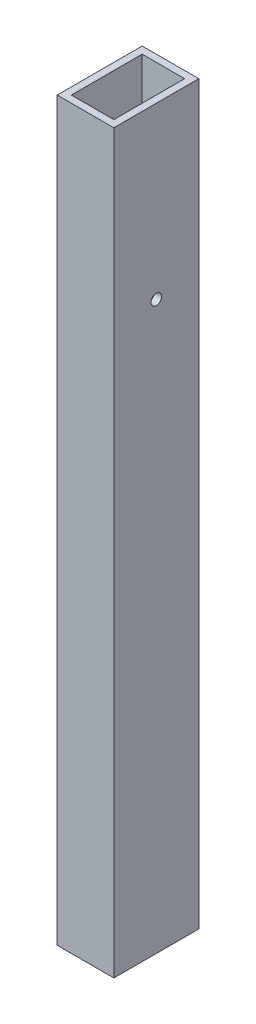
ISO-10303-21;
HEADER;
FILE_DESCRIPTION(('STEP AP214'),'2;1');
FILE_NAME('part.step','',(''),(''),'','','');
FILE_SCHEMA(('AUTOMOTIVE_DESIGN { 1 0 10303 214 1 1 1 1 }'));
ENDSEC;
DATA;
#1=APPLICATION_CONTEXT('core data for automotive mechanical design processes');
#2=APPLICATION_PROTOCOL_DEFINITION('international standard','automotive_design',2000,#1);
#3=PRODUCT_CONTEXT('',#1,'mechanical');
#4=PRODUCT('Part','Part','',(#3));
#5=PRODUCT_RELATED_PRODUCT_CATEGORY('part','',(#4));
#6=PRODUCT_DEFINITION_FORMATION('','',#4);
#7=PRODUCT_DEFINITION_CONTEXT('part definition',#1,'design');
#8=PRODUCT_DEFINITION('design','',#6,#7);
#9=PRODUCT_DEFINITION_SHAPE('','',#8);
#10=(LENGTH_UNIT() NAMED_UNIT(*) SI_UNIT(.MILLI.,.METRE.));
#11=(NAMED_UNIT(*) PLANE_ANGLE_UNIT() SI_UNIT($,.RADIAN.));
#12=(NAMED_UNIT(*) SI_UNIT($,.STERADIAN.) SOLID_ANGLE_UNIT());
#13=UNCERTAINTY_MEASURE_WITH_UNIT(LENGTH_MEASURE(1.E-05),#10,'distance_accuracy_value','');
#14=(GEOMETRIC_REPRESENTATION_CONTEXT(3) GLOBAL_UNCERTAINTY_ASSIGNED_CONTEXT((#13)) GLOBAL_UNIT_ASSIGNED_CONTEXT((#10,
#11,#12)) REPRESENTATION_CONTEXT('',''));
#15=CARTESIAN_POINT('',(0.,0.,0.));
#16=DIRECTION('',(0.,0.,1.));
#17=DIRECTION('',(1.,0.,0.));
#18=AXIS2_PLACEMENT_3D('',#15,#16,#17);
#19=CARTESIAN_POINT('',(-25.4,-660.4,38.1));
#20=DIRECTION('',(-1.,0.,0.));
#21=DIRECTION('',(0.,0.,1.));
#22=AXIS2_PLACEMENT_3D('',#19,#20,#21);
#23=PLANE('',#22);
#24=CARTESIAN_POINT('',(-25.4,-152.4,0.));
#25=DIRECTION('',(-1.,0.,0.));
#26=DIRECTION('',(0.,0.,1.));
#27=AXIS2_PLACEMENT_3D('',#24,#25,#26);
#28=CIRCLE('',#27,4.76249999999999);
#29=CARTESIAN_POINT('',(-25.4,-152.4,4.76249999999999));
#30=VERTEX_POINT('',#29);
#31=EDGE_CURVE('E191',#30,#30,#28,.T.);
#32=ORIENTED_EDGE('',*,*,#31,.F.);
#33=EDGE_LOOP('',(#32));
#34=FACE_BOUND('',#33,.T.);
#35=DIRECTION('',(0.,0.,1.));
#36=VECTOR('',#35,1.);
#37=CARTESIAN_POINT('',(-25.4,0.,38.1));
#38=LINE('',#37,#36);
#39=CARTESIAN_POINT('',(-25.4,0.,-38.1));
#40=VERTEX_POINT('',#39);
#41=CARTESIAN_POINT('',(-25.4,0.,38.1));
#42=VERTEX_POINT('',#41);
#43=EDGE_CURVE('E130',#40,#42,#38,.T.);
#44=ORIENTED_EDGE('',*,*,#43,.F.);
#45=DIRECTION('',(0.,1.,0.));
#46=VECTOR('',#45,1.);
#47=CARTESIAN_POINT('',(-25.4,-660.4,-38.1));
#48=LINE('',#47,#46);
#49=CARTESIAN_POINT('',(-25.4,-660.4,-38.1));
#50=VERTEX_POINT('',#49);
#51=EDGE_CURVE('E11',#50,#40,#48,.T.);
#52=ORIENTED_EDGE('',*,*,#51,.F.);
#53=DIRECTION('',(0.,0.,1.));
#54=VECTOR('',#53,1.);
#55=CARTESIAN_POINT('',(-25.4,-660.4,38.1));
#56=LINE('',#55,#54);
#57=CARTESIAN_POINT('',(-25.4,-660.4,38.1));
#58=VERTEX_POINT('',#57);
#59=EDGE_CURVE('E144',#50,#58,#56,.T.);
#60=ORIENTED_EDGE('',*,*,#59,.T.);
#61=DIRECTION('',(0.,1.,0.));
#62=VECTOR('',#61,1.);
#63=CARTESIAN_POINT('',(-25.4,-660.4,38.1));
#64=LINE('',#63,#62);
#65=EDGE_CURVE('E155',#58,#42,#64,.T.);
#66=ORIENTED_EDGE('',*,*,#65,.T.);
#67=EDGE_LOOP('',(#44,#52,#60,#66));
#68=FACE_BOUND('',#67,.T.);
#69=ADVANCED_FACE('F31',(#34,#68),#23,.T.);
#70=CARTESIAN_POINT('',(-25.4,-660.4,-38.1));
#71=DIRECTION('',(0.,0.,-1.));
#72=DIRECTION('',(-1.,0.,0.));
#73=AXIS2_PLACEMENT_3D('',#70,#71,#72);
#74=PLANE('',#73);
#75=DIRECTION('',(-1.,0.,0.));
#76=VECTOR('',#75,1.);
#77=CARTESIAN_POINT('',(-25.4,0.,-38.1));
#78=LINE('',#77,#76);
#79=CARTESIAN_POINT('',(25.4,0.,-38.1));
#80=VERTEX_POINT('',#79);
#81=EDGE_CURVE('E141',#80,#40,#78,.T.);
#82=ORIENTED_EDGE('',*,*,#81,.F.);
#83=DIRECTION('',(0.,1.,0.));
#84=VECTOR('',#83,1.);
#85=CARTESIAN_POINT('',(25.4,-660.4,-38.1));
#86=LINE('',#85,#84);
#87=CARTESIAN_POINT('',(25.4,-660.4,-38.1));
#88=VERTEX_POINT('',#87);
#89=EDGE_CURVE('E39',#88,#80,#86,.T.);
#90=ORIENTED_EDGE('',*,*,#89,.F.);
#91=DIRECTION('',(-1.,0.,0.));
#92=VECTOR('',#91,1.);
#93=CARTESIAN_POINT('',(-25.4,-660.4,-38.1));
#94=LINE('',#93,#92);
#95=EDGE_CURVE('E153',#88,#50,#94,.T.);
#96=ORIENTED_EDGE('',*,*,#95,.T.);
#97=ORIENTED_EDGE('',*,*,#51,.T.);
#98=EDGE_LOOP('',(#82,#90,#96,#97));
#99=FACE_BOUND('',#98,.T.);
#100=ADVANCED_FACE('F169',(#99),#74,.T.);
#101=CARTESIAN_POINT('',(25.4,-660.4,38.1));
#102=DIRECTION('',(1.,0.,0.));
#103=DIRECTION('',(0.,0.,-1.));
#104=AXIS2_PLACEMENT_3D('',#101,#102,#103);
#105=PLANE('',#104);
#106=CARTESIAN_POINT('',(25.4,-152.4,0.));
#107=DIRECTION('',(1.,0.,0.));
#108=DIRECTION('',(0.,0.,-1.));
#109=AXIS2_PLACEMENT_3D('',#106,#107,#108);
#110=CIRCLE('',#109,4.76249999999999);
#111=CARTESIAN_POINT('',(25.4,-152.4,-4.76249999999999));
#112=VERTEX_POINT('',#111);
#113=EDGE_CURVE('E198',#112,#112,#110,.T.);
#114=ORIENTED_EDGE('',*,*,#113,.F.);
#115=EDGE_LOOP('',(#114));
#116=FACE_BOUND('',#115,.T.);
#117=DIRECTION('',(0.,0.,-1.));
#118=VECTOR('',#117,1.);
#119=CARTESIAN_POINT('',(25.4,0.,38.1));
#120=LINE('',#119,#118);
#121=CARTESIAN_POINT('',(25.4,0.,38.1));
#122=VERTEX_POINT('',#121);
#123=EDGE_CURVE('E138',#122,#80,#120,.T.);
#124=ORIENTED_EDGE('',*,*,#123,.F.);
#125=DIRECTION('',(0.,1.,0.));
#126=VECTOR('',#125,1.);
#127=CARTESIAN_POINT('',(25.4,-660.4,38.1));
#128=LINE('',#127,#126);
#129=CARTESIAN_POINT('',(25.4,-660.4,38.1));
#130=VERTEX_POINT('',#129);
#131=EDGE_CURVE('E158',#130,#122,#128,.T.);
#132=ORIENTED_EDGE('',*,*,#131,.F.);
#133=DIRECTION('',(0.,0.,-1.));
#134=VECTOR('',#133,1.);
#135=CARTESIAN_POINT('',(25.4,-660.4,38.1));
#136=LINE('',#135,#134);
#137=EDGE_CURVE('E150',#130,#88,#136,.T.);
#138=ORIENTED_EDGE('',*,*,#137,.T.);
#139=ORIENTED_EDGE('',*,*,#89,.T.);
#140=EDGE_LOOP('',(#124,#132,#138,#139));
#141=FACE_BOUND('',#140,.T.);
#142=ADVANCED_FACE('F175',(#116,#141),#105,.T.);
#143=CARTESIAN_POINT('',(-25.4,-660.4,38.1));
#144=DIRECTION('',(0.,0.,1.));
#145=DIRECTION('',(1.,0.,0.));
#146=AXIS2_PLACEMENT_3D('',#143,#144,#145);
#147=PLANE('',#146);
#148=DIRECTION('',(1.,0.,0.));
#149=VECTOR('',#148,1.);
#150=CARTESIAN_POINT('',(-25.4,0.,38.1));
#151=LINE('',#150,#149);
#152=EDGE_CURVE('E135',#42,#122,#151,.T.);
#153=ORIENTED_EDGE('',*,*,#152,.F.);
#154=ORIENTED_EDGE('',*,*,#65,.F.);
#155=DIRECTION('',(1.,0.,0.));
#156=VECTOR('',#155,1.);
#157=CARTESIAN_POINT('',(-25.4,-660.4,38.1));
#158=LINE('',#157,#156);
#159=EDGE_CURVE('E147',#58,#130,#158,.T.);
#160=ORIENTED_EDGE('',*,*,#159,.T.);
#161=ORIENTED_EDGE('',*,*,#131,.T.);
#162=EDGE_LOOP('',(#153,#154,#160,#161));
#163=FACE_BOUND('',#162,.T.);
#164=ADVANCED_FACE('F165',(#163),#147,.T.);
#165=CARTESIAN_POINT('',(-25.4,-660.4,-38.1));
#166=DIRECTION('',(0.,-1.,0.));
#167=DIRECTION('',(0.,0.,-1.));
#168=AXIS2_PLACEMENT_3D('',#165,#166,#167);
#169=PLANE('',#168);
#170=DIRECTION('',(1.,0.,0.));
#171=VECTOR('',#170,1.);
#172=CARTESIAN_POINT('',(-19.05,-660.4,31.75));
#173=LINE('',#172,#171);
#174=CARTESIAN_POINT('',(-19.05,-660.4,31.75));
#175=VERTEX_POINT('',#174);
#176=CARTESIAN_POINT('',(19.05,-660.4,31.75));
#177=VERTEX_POINT('',#176);
#178=EDGE_CURVE('E116',#175,#177,#173,.T.);
#179=ORIENTED_EDGE('',*,*,#178,.T.);
#180=DIRECTION('',(0.,0.,-1.));
#181=VECTOR('',#180,1.);
#182=CARTESIAN_POINT('',(19.05,-660.4,31.75));
#183=LINE('',#182,#181);
#184=CARTESIAN_POINT('',(19.05,-660.4,-31.75));
#185=VERTEX_POINT('',#184);
#186=EDGE_CURVE('E122',#177,#185,#183,.T.);
#187=ORIENTED_EDGE('',*,*,#186,.T.);
#188=DIRECTION('',(-1.,0.,0.));
#189=VECTOR('',#188,1.);
#190=CARTESIAN_POINT('',(-19.05,-660.4,-31.75));
#191=LINE('',#190,#189);
#192=CARTESIAN_POINT('',(-19.05,-660.4,-31.75));
#193=VERTEX_POINT('',#192);
#194=EDGE_CURVE('E47',#185,#193,#191,.T.);
#195=ORIENTED_EDGE('',*,*,#194,.T.);
#196=DIRECTION('',(0.,0.,1.));
#197=VECTOR('',#196,1.);
#198=CARTESIAN_POINT('',(-19.05,-660.4,31.75));
#199=LINE('',#198,#197);
#200=EDGE_CURVE('E125',#193,#175,#199,.T.);
#201=ORIENTED_EDGE('',*,*,#200,.T.);
#202=EDGE_LOOP('',(#179,#187,#195,#201));
#203=FACE_BOUND('',#202,.T.);
#204=ORIENTED_EDGE('',*,*,#59,.F.);
#205=ORIENTED_EDGE('',*,*,#95,.F.);
#206=ORIENTED_EDGE('',*,*,#137,.F.);
#207=ORIENTED_EDGE('',*,*,#159,.F.);
#208=EDGE_LOOP('',(#204,#205,#206,#207));
#209=FACE_BOUND('',#208,.T.);
#210=ADVANCED_FACE('F172',(#203,#209),#169,.T.);
#211=CARTESIAN_POINT('',(-25.4,0.,-38.1));
#212=DIRECTION('',(0.,-1.,0.));
#213=DIRECTION('',(0.,0.,-1.));
#214=AXIS2_PLACEMENT_3D('',#211,#212,#213);
#215=PLANE('',#214);
#216=DIRECTION('',(0.,0.,-1.));
#217=VECTOR('',#216,1.);
#218=CARTESIAN_POINT('',(19.05,0.,31.75));
#219=LINE('',#218,#217);
#220=CARTESIAN_POINT('',(19.05,0.,31.75));
#221=VERTEX_POINT('',#220);
#222=CARTESIAN_POINT('',(19.05,0.,-31.75));
#223=VERTEX_POINT('',#222);
#224=EDGE_CURVE('E107',#221,#223,#219,.T.);
#225=ORIENTED_EDGE('',*,*,#224,.F.);
#226=DIRECTION('',(1.,0.,0.));
#227=VECTOR('',#226,1.);
#228=CARTESIAN_POINT('',(-19.05,0.,31.75));
#229=LINE('',#228,#227);
#230=CARTESIAN_POINT('',(-19.05,0.,31.75));
#231=VERTEX_POINT('',#230);
#232=EDGE_CURVE('E55',#231,#221,#229,.T.);
#233=ORIENTED_EDGE('',*,*,#232,.F.);
#234=DIRECTION('',(0.,0.,1.));
#235=VECTOR('',#234,1.);
#236=CARTESIAN_POINT('',(-19.05,0.,31.75));
#237=LINE('',#236,#235);
#238=CARTESIAN_POINT('',(-19.05,0.,-31.75));
#239=VERTEX_POINT('',#238);
#240=EDGE_CURVE('E114',#239,#231,#237,.T.);
#241=ORIENTED_EDGE('',*,*,#240,.F.);
#242=DIRECTION('',(-1.,0.,0.));
#243=VECTOR('',#242,1.);
#244=CARTESIAN_POINT('',(-19.05,0.,-31.75));
#245=LINE('',#244,#243);
#246=EDGE_CURVE('E98',#223,#239,#245,.T.);
#247=ORIENTED_EDGE('',*,*,#246,.F.);
#248=EDGE_LOOP('',(#225,#233,#241,#247));
#249=FACE_BOUND('',#248,.T.);
#250=ORIENTED_EDGE('',*,*,#43,.T.);
#251=ORIENTED_EDGE('',*,*,#152,.T.);
#252=ORIENTED_EDGE('',*,*,#123,.T.);
#253=ORIENTED_EDGE('',*,*,#81,.T.);
#254=EDGE_LOOP('',(#250,#251,#252,#253));
#255=FACE_BOUND('',#254,.T.);
#256=ADVANCED_FACE('F111',(#249,#255),#215,.F.);
#257=CARTESIAN_POINT('',(-19.05,-660.4,31.75));
#258=DIRECTION('',(0.,0.,1.));
#259=DIRECTION('',(1.,0.,0.));
#260=AXIS2_PLACEMENT_3D('',#257,#258,#259);
#261=PLANE('',#260);
#262=ORIENTED_EDGE('',*,*,#232,.T.);
#263=DIRECTION('',(0.,1.,0.));
#264=VECTOR('',#263,1.);
#265=CARTESIAN_POINT('',(19.05,-660.4,31.75));
#266=LINE('',#265,#264);
#267=EDGE_CURVE('E104',#177,#221,#266,.T.);
#268=ORIENTED_EDGE('',*,*,#267,.F.);
#269=ORIENTED_EDGE('',*,*,#178,.F.);
#270=DIRECTION('',(0.,1.,0.));
#271=VECTOR('',#270,1.);
#272=CARTESIAN_POINT('',(-19.05,-660.4,31.75));
#273=LINE('',#272,#271);
#274=EDGE_CURVE('E128',#175,#231,#273,.T.);
#275=ORIENTED_EDGE('',*,*,#274,.T.);
#276=EDGE_LOOP('',(#262,#268,#269,#275));
#277=FACE_BOUND('',#276,.T.);
#278=ADVANCED_FACE('F218',(#277),#261,.F.);
#279=CARTESIAN_POINT('',(-19.05,-660.4,31.75));
#280=DIRECTION('',(-1.,0.,0.));
#281=DIRECTION('',(0.,0.,1.));
#282=AXIS2_PLACEMENT_3D('',#279,#280,#281);
#283=PLANE('',#282);
#284=CARTESIAN_POINT('',(-19.05,-152.4,0.));
#285=DIRECTION('',(-1.,0.,0.));
#286=DIRECTION('',(0.,0.,1.));
#287=AXIS2_PLACEMENT_3D('',#284,#285,#286);
#288=CIRCLE('',#287,4.76249999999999);
#289=CARTESIAN_POINT('',(-19.05,-152.4,4.76249999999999));
#290=VERTEX_POINT('',#289);
#291=EDGE_CURVE('E193',#290,#290,#288,.T.);
#292=ORIENTED_EDGE('',*,*,#291,.T.);
#293=EDGE_LOOP('',(#292));
#294=FACE_BOUND('',#293,.T.);
#295=ORIENTED_EDGE('',*,*,#240,.T.);
#296=ORIENTED_EDGE('',*,*,#274,.F.);
#297=ORIENTED_EDGE('',*,*,#200,.F.);
#298=DIRECTION('',(0.,1.,0.));
#299=VECTOR('',#298,1.);
#300=CARTESIAN_POINT('',(-19.05,-660.4,-31.75));
#301=LINE('',#300,#299);
#302=EDGE_CURVE('E103',#193,#239,#301,.T.);
#303=ORIENTED_EDGE('',*,*,#302,.T.);
#304=EDGE_LOOP('',(#295,#296,#297,#303));
#305=FACE_BOUND('',#304,.T.);
#306=ADVANCED_FACE('F215',(#294,#305),#283,.F.);
#307=CARTESIAN_POINT('',(-19.05,-660.4,-31.75));
#308=DIRECTION('',(0.,0.,-1.));
#309=DIRECTION('',(-1.,0.,0.));
#310=AXIS2_PLACEMENT_3D('',#307,#308,#309);
#311=PLANE('',#310);
#312=ORIENTED_EDGE('',*,*,#246,.T.);
#313=ORIENTED_EDGE('',*,*,#302,.F.);
#314=ORIENTED_EDGE('',*,*,#194,.F.);
#315=DIRECTION('',(0.,1.,0.));
#316=VECTOR('',#315,1.);
#317=CARTESIAN_POINT('',(19.05,-660.4,-31.75));
#318=LINE('',#317,#316);
#319=EDGE_CURVE('E94',#185,#223,#318,.T.);
#320=ORIENTED_EDGE('',*,*,#319,.T.);
#321=EDGE_LOOP('',(#312,#313,#314,#320));
#322=FACE_BOUND('',#321,.T.);
#323=ADVANCED_FACE('F96',(#322),#311,.F.);
#324=CARTESIAN_POINT('',(19.05,-660.4,31.75));
#325=DIRECTION('',(1.,0.,0.));
#326=DIRECTION('',(0.,0.,-1.));
#327=AXIS2_PLACEMENT_3D('',#324,#325,#326);
#328=PLANE('',#327);
#329=CARTESIAN_POINT('',(19.05,-152.4,0.));
#330=DIRECTION('',(1.,0.,0.));
#331=DIRECTION('',(0.,0.,-1.));
#332=AXIS2_PLACEMENT_3D('',#329,#330,#331);
#333=CIRCLE('',#332,4.76249999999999);
#334=CARTESIAN_POINT('',(19.05,-152.4,-4.76249999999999));
#335=VERTEX_POINT('',#334);
#336=EDGE_CURVE('E34',#335,#335,#333,.T.);
#337=ORIENTED_EDGE('',*,*,#336,.T.);
#338=EDGE_LOOP('',(#337));
#339=FACE_BOUND('',#338,.T.);
#340=ORIENTED_EDGE('',*,*,#224,.T.);
#341=ORIENTED_EDGE('',*,*,#319,.F.);
#342=ORIENTED_EDGE('',*,*,#186,.F.);
#343=ORIENTED_EDGE('',*,*,#267,.T.);
#344=EDGE_LOOP('',(#340,#341,#342,#343));
#345=FACE_BOUND('',#344,.T.);
#346=ADVANCED_FACE('F108',(#339,#345),#328,.F.);
#347=CARTESIAN_POINT('',(-431.8,-152.4,0.));
#348=DIRECTION('',(1.,0.,0.));
#349=DIRECTION('',(0.,0.,-1.));
#350=AXIS2_PLACEMENT_3D('',#347,#348,#349);
#351=CYLINDRICAL_SURFACE('',#350,4.76249999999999);
#352=ORIENTED_EDGE('',*,*,#113,.T.);
#353=EDGE_LOOP('',(#352));
#354=FACE_BOUND('',#353,.T.);
#355=ORIENTED_EDGE('',*,*,#336,.F.);
#356=EDGE_LOOP('',(#355));
#357=FACE_BOUND('',#356,.T.);
#358=ADVANCED_FACE('F205',(#354,#357),#351,.F.);
#359=ORIENTED_EDGE('',*,*,#31,.T.);
#360=EDGE_LOOP('',(#359));
#361=FACE_BOUND('',#360,.T.);
#362=ORIENTED_EDGE('',*,*,#291,.F.);
#363=EDGE_LOOP('',(#362));
#364=FACE_BOUND('',#363,.T.);
#365=ADVANCED_FACE('F207',(#361,#364),#351,.F.);
#366=CLOSED_SHELL('',(#69,#100,#142,#164,#210,#256,#278,#306,#323,#346,#358,#365));
#367=MANIFOLD_SOLID_BREP('B2',#366);
#368=ADVANCED_BREP_SHAPE_REPRESENTATION('',(#18,#367),#14);
#369=SHAPE_DEFINITION_REPRESENTATION(#9,#368);
ENDSEC;
END-ISO-10303-21;
